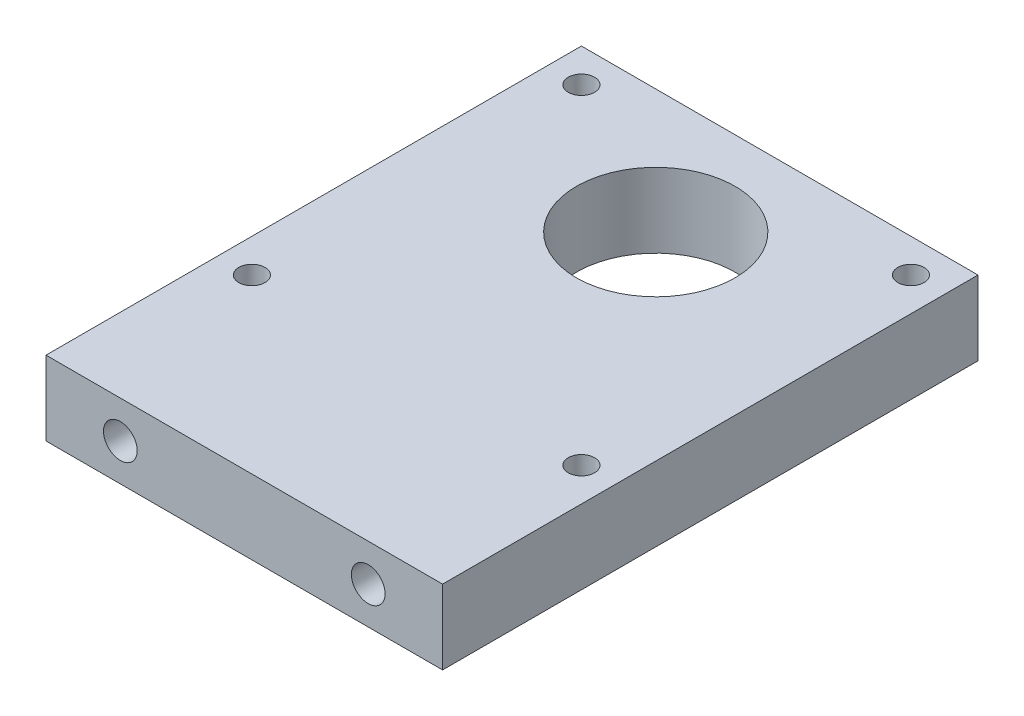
ISO-10303-21;
HEADER;
FILE_DESCRIPTION(('STEP AP214'),'2;1');
FILE_NAME('part.step','',(''),(''),'','','');
FILE_SCHEMA(('AUTOMOTIVE_DESIGN { 1 0 10303 214 1 1 1 1 }'));
ENDSEC;
DATA;
#1=APPLICATION_CONTEXT('core data for automotive mechanical design processes');
#2=APPLICATION_PROTOCOL_DEFINITION('international standard','automotive_design',2000,#1);
#3=PRODUCT_CONTEXT('',#1,'mechanical');
#4=PRODUCT('Part','Part','',(#3));
#5=PRODUCT_RELATED_PRODUCT_CATEGORY('part','',(#4));
#6=PRODUCT_DEFINITION_FORMATION('','',#4);
#7=PRODUCT_DEFINITION_CONTEXT('part definition',#1,'design');
#8=PRODUCT_DEFINITION('design','',#6,#7);
#9=PRODUCT_DEFINITION_SHAPE('','',#8);
#10=(LENGTH_UNIT() NAMED_UNIT(*) SI_UNIT(.MILLI.,.METRE.));
#11=(NAMED_UNIT(*) PLANE_ANGLE_UNIT() SI_UNIT($,.RADIAN.));
#12=(NAMED_UNIT(*) SI_UNIT($,.STERADIAN.) SOLID_ANGLE_UNIT());
#13=UNCERTAINTY_MEASURE_WITH_UNIT(LENGTH_MEASURE(1.E-05),#10,'distance_accuracy_value','');
#14=(GEOMETRIC_REPRESENTATION_CONTEXT(3) GLOBAL_UNCERTAINTY_ASSIGNED_CONTEXT((#13)) GLOBAL_UNIT_ASSIGNED_CONTEXT((#10,
#11,#12)) REPRESENTATION_CONTEXT('',''));
#15=CARTESIAN_POINT('',(0.,0.,0.));
#16=DIRECTION('',(0.,0.,1.));
#17=DIRECTION('',(1.,0.,0.));
#18=AXIS2_PLACEMENT_3D('',#15,#16,#17);
#19=CARTESIAN_POINT('',(25.,7.5,34.2499999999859));
#20=DIRECTION('',(0.,0.,1.));
#21=DIRECTION('',(1.,0.,0.));
#22=AXIS2_PLACEMENT_3D('',#19,#20,#21);
#23=CONICAL_SURFACE('',#22,3.40000000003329,1.02974425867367);
#24=CARTESIAN_POINT('',(25.0000000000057,7.5,32.2070738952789));
#25=VERTEX_POINT('',#24);
#26=VERTEX_LOOP('',#25);
#27=FACE_BOUND('',#26,.T.);
#28=CARTESIAN_POINT('',(25.,7.5,34.25));
#29=DIRECTION('',(0.,0.,1.));
#30=DIRECTION('',(1.,0.,0.));
#31=AXIS2_PLACEMENT_3D('',#28,#29,#30);
#32=CIRCLE('',#31,3.4);
#33=CARTESIAN_POINT('',(28.4,7.5,34.25));
#34=VERTEX_POINT('',#33);
#35=EDGE_CURVE('E66',#34,#34,#32,.T.);
#36=ORIENTED_EDGE('',*,*,#35,.T.);
#37=EDGE_LOOP('',(#36));
#38=FACE_BOUND('',#37,.T.);
#39=ADVANCED_FACE('F17',(#27,#38),#23,.F.);
#40=CARTESIAN_POINT('',(-25.,7.49999999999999,34.2499999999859));
#41=DIRECTION('',(0.,0.,1.));
#42=DIRECTION('',(1.,0.,0.));
#43=AXIS2_PLACEMENT_3D('',#40,#41,#42);
#44=CONICAL_SURFACE('',#43,3.40000000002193,1.02974425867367);
#45=CARTESIAN_POINT('',(-25.0000000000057,7.49999999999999,32.2070738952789));
#46=VERTEX_POINT('',#45);
#47=VERTEX_LOOP('',#46);
#48=FACE_BOUND('',#47,.T.);
#49=CARTESIAN_POINT('',(-25.,7.49999999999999,34.25));
#50=DIRECTION('',(0.,0.,1.));
#51=DIRECTION('',(1.,0.,0.));
#52=AXIS2_PLACEMENT_3D('',#49,#50,#51);
#53=CIRCLE('',#52,3.4);
#54=CARTESIAN_POINT('',(-21.6,7.49999999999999,34.25));
#55=VERTEX_POINT('',#54);
#56=EDGE_CURVE('E68',#55,#55,#53,.T.);
#57=ORIENTED_EDGE('',*,*,#56,.T.);
#58=EDGE_LOOP('',(#57));
#59=FACE_BOUND('',#58,.T.);
#60=ADVANCED_FACE('F63',(#48,#59),#44,.F.);
#61=CARTESIAN_POINT('',(-33.2340187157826,0.,-47.2340187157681));
#62=DIRECTION('',(0.,-1.,0.));
#63=DIRECTION('',(0.,0.,-1.));
#64=AXIS2_PLACEMENT_3D('',#61,#62,#63);
#65=CYLINDRICAL_SURFACE('',#64,5.);
#66=CARTESIAN_POINT('',(-33.2340187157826,5.7,-47.2340187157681));
#67=DIRECTION('',(0.,-1.,0.));
#68=DIRECTION('',(0.,0.,-1.));
#69=AXIS2_PLACEMENT_3D('',#66,#67,#68);
#70=CIRCLE('',#69,5.);
#71=CARTESIAN_POINT('',(-33.2340187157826,5.7,-52.2340187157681));
#72=VERTEX_POINT('',#71);
#73=EDGE_CURVE('E20',#72,#72,#70,.F.);
#74=ORIENTED_EDGE('',*,*,#73,.T.);
#75=EDGE_LOOP('',(#74));
#76=FACE_BOUND('',#75,.T.);
#77=CARTESIAN_POINT('',(-33.2340187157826,0.,-47.2340187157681));
#78=DIRECTION('',(0.,-1.,0.));
#79=DIRECTION('',(0.,0.,-1.));
#80=AXIS2_PLACEMENT_3D('',#77,#78,#79);
#81=CIRCLE('',#80,5.);
#82=CARTESIAN_POINT('',(-33.2340187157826,0.,-52.2340187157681));
#83=VERTEX_POINT('',#82);
#84=EDGE_CURVE('E72',#83,#83,#81,.T.);
#85=ORIENTED_EDGE('',*,*,#84,.T.);
#86=EDGE_LOOP('',(#85));
#87=FACE_BOUND('',#86,.T.);
#88=ADVANCED_FACE('F138',(#76,#87),#65,.F.);
#89=CARTESIAN_POINT('',(-33.2340187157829,0.,19.2340187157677));
#90=DIRECTION('',(0.,-1.,0.));
#91=DIRECTION('',(0.,0.,-1.));
#92=AXIS2_PLACEMENT_3D('',#89,#90,#91);
#93=CYLINDRICAL_SURFACE('',#92,5.);
#94=CARTESIAN_POINT('',(-33.2340187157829,5.7,19.2340187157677));
#95=DIRECTION('',(0.,-1.,0.));
#96=DIRECTION('',(0.,0.,-1.));
#97=AXIS2_PLACEMENT_3D('',#94,#95,#96);
#98=CIRCLE('',#97,5.);
#99=CARTESIAN_POINT('',(-33.2340187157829,5.7,14.2340187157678));
#100=VERTEX_POINT('',#99);
#101=EDGE_CURVE('E131',#100,#100,#98,.F.);
#102=ORIENTED_EDGE('',*,*,#101,.T.);
#103=EDGE_LOOP('',(#102));
#104=FACE_BOUND('',#103,.T.);
#105=CARTESIAN_POINT('',(-33.2340187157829,0.,19.2340187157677));
#106=DIRECTION('',(0.,-1.,0.));
#107=DIRECTION('',(0.,0.,-1.));
#108=AXIS2_PLACEMENT_3D('',#105,#106,#107);
#109=CIRCLE('',#108,5.);
#110=CARTESIAN_POINT('',(-33.2340187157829,0.,14.2340187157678));
#111=VERTEX_POINT('',#110);
#112=EDGE_CURVE('E125',#111,#111,#109,.T.);
#113=ORIENTED_EDGE('',*,*,#112,.T.);
#114=EDGE_LOOP('',(#113));
#115=FACE_BOUND('',#114,.T.);
#116=ADVANCED_FACE('F224',(#104,#115),#93,.F.);
#117=CARTESIAN_POINT('',(33.2340187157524,0.,19.2340187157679));
#118=DIRECTION('',(0.,-1.,0.));
#119=DIRECTION('',(0.,0.,-1.));
#120=AXIS2_PLACEMENT_3D('',#117,#118,#119);
#121=CYLINDRICAL_SURFACE('',#120,4.99999999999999);
#122=CARTESIAN_POINT('',(33.2340187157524,5.7,19.2340187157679));
#123=DIRECTION('',(0.,-1.,0.));
#124=DIRECTION('',(0.,0.,-1.));
#125=AXIS2_PLACEMENT_3D('',#122,#123,#124);
#126=CIRCLE('',#125,4.99999999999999);
#127=CARTESIAN_POINT('',(33.2340187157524,5.7,14.2340187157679));
#128=VERTEX_POINT('',#127);
#129=EDGE_CURVE('E75',#128,#128,#126,.F.);
#130=ORIENTED_EDGE('',*,*,#129,.T.);
#131=EDGE_LOOP('',(#130));
#132=FACE_BOUND('',#131,.T.);
#133=CARTESIAN_POINT('',(33.2340187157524,0.,19.2340187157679));
#134=DIRECTION('',(0.,-1.,0.));
#135=DIRECTION('',(0.,0.,-1.));
#136=AXIS2_PLACEMENT_3D('',#133,#134,#135);
#137=CIRCLE('',#136,4.99999999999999);
#138=CARTESIAN_POINT('',(33.2340187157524,0.,14.2340187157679));
#139=VERTEX_POINT('',#138);
#140=EDGE_CURVE('E122',#139,#139,#137,.T.);
#141=ORIENTED_EDGE('',*,*,#140,.T.);
#142=EDGE_LOOP('',(#141));
#143=FACE_BOUND('',#142,.T.);
#144=ADVANCED_FACE('F220',(#132,#143),#121,.F.);
#145=CARTESIAN_POINT('',(33.2340187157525,0.,-47.2340187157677));
#146=DIRECTION('',(0.,-1.,0.));
#147=DIRECTION('',(0.,0.,-1.));
#148=AXIS2_PLACEMENT_3D('',#145,#146,#147);
#149=CYLINDRICAL_SURFACE('',#148,5.);
#150=CARTESIAN_POINT('',(33.2340187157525,5.7,-47.2340187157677));
#151=DIRECTION('',(0.,-1.,0.));
#152=DIRECTION('',(0.,0.,-1.));
#153=AXIS2_PLACEMENT_3D('',#150,#151,#152);
#154=CIRCLE('',#153,5.);
#155=CARTESIAN_POINT('',(33.2340187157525,5.7,-52.2340187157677));
#156=VERTEX_POINT('',#155);
#157=EDGE_CURVE('E69',#156,#156,#154,.F.);
#158=ORIENTED_EDGE('',*,*,#157,.T.);
#159=EDGE_LOOP('',(#158));
#160=FACE_BOUND('',#159,.T.);
#161=CARTESIAN_POINT('',(33.2340187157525,0.,-47.2340187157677));
#162=DIRECTION('',(0.,-1.,0.));
#163=DIRECTION('',(0.,0.,-1.));
#164=AXIS2_PLACEMENT_3D('',#161,#162,#163);
#165=CIRCLE('',#164,5.);
#166=CARTESIAN_POINT('',(33.2340187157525,0.,-52.2340187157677));
#167=VERTEX_POINT('',#166);
#168=EDGE_CURVE('E119',#167,#167,#165,.T.);
#169=ORIENTED_EDGE('',*,*,#168,.T.);
#170=EDGE_LOOP('',(#169));
#171=FACE_BOUND('',#170,.T.);
#172=ADVANCED_FACE('F145',(#160,#171),#149,.F.);
#173=CARTESIAN_POINT('',(-30.5840187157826,5.7,-47.2340187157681));
#174=DIRECTION('',(0.,1.,0.));
#175=DIRECTION('',(0.,0.,1.));
#176=AXIS2_PLACEMENT_3D('',#173,#174,#175);
#177=PLANE('',#176);
#178=ORIENTED_EDGE('',*,*,#73,.F.);
#179=EDGE_LOOP('',(#178));
#180=FACE_BOUND('',#179,.T.);
#181=CARTESIAN_POINT('',(-33.2340187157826,5.7,-47.2340187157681));
#182=DIRECTION('',(0.,-1.,0.));
#183=DIRECTION('',(0.,0.,-1.));
#184=AXIS2_PLACEMENT_3D('',#181,#182,#183);
#185=CIRCLE('',#184,2.65);
#186=CARTESIAN_POINT('',(-33.2340187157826,5.7,-49.8840187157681));
#187=VERTEX_POINT('',#186);
#188=EDGE_CURVE('E116',#187,#187,#185,.F.);
#189=ORIENTED_EDGE('',*,*,#188,.T.);
#190=EDGE_LOOP('',(#189));
#191=FACE_BOUND('',#190,.T.);
#192=ADVANCED_FACE('F141',(#180,#191),#177,.F.);
#193=CARTESIAN_POINT('',(-30.5840187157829,5.7,19.2340187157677));
#194=DIRECTION('',(0.,1.,0.));
#195=DIRECTION('',(0.,0.,1.));
#196=AXIS2_PLACEMENT_3D('',#193,#194,#195);
#197=PLANE('',#196);
#198=ORIENTED_EDGE('',*,*,#101,.F.);
#199=EDGE_LOOP('',(#198));
#200=FACE_BOUND('',#199,.T.);
#201=CARTESIAN_POINT('',(-33.2340187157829,5.7,19.2340187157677));
#202=DIRECTION('',(0.,-1.,0.));
#203=DIRECTION('',(0.,0.,-1.));
#204=AXIS2_PLACEMENT_3D('',#201,#202,#203);
#205=CIRCLE('',#204,2.65);
#206=CARTESIAN_POINT('',(-33.2340187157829,5.7,16.5840187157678));
#207=VERTEX_POINT('',#206);
#208=EDGE_CURVE('E113',#207,#207,#205,.F.);
#209=ORIENTED_EDGE('',*,*,#208,.T.);
#210=EDGE_LOOP('',(#209));
#211=FACE_BOUND('',#210,.T.);
#212=ADVANCED_FACE('F144',(#200,#211),#197,.F.);
#213=CARTESIAN_POINT('',(35.8840187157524,5.7,19.2340187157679));
#214=DIRECTION('',(0.,1.,0.));
#215=DIRECTION('',(0.,0.,1.));
#216=AXIS2_PLACEMENT_3D('',#213,#214,#215);
#217=PLANE('',#216);
#218=ORIENTED_EDGE('',*,*,#129,.F.);
#219=EDGE_LOOP('',(#218));
#220=FACE_BOUND('',#219,.T.);
#221=CARTESIAN_POINT('',(33.2340187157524,5.7,19.2340187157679));
#222=DIRECTION('',(0.,-1.,0.));
#223=DIRECTION('',(0.,0.,-1.));
#224=AXIS2_PLACEMENT_3D('',#221,#222,#223);
#225=CIRCLE('',#224,2.65);
#226=CARTESIAN_POINT('',(33.2340187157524,5.7,16.5840187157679));
#227=VERTEX_POINT('',#226);
#228=EDGE_CURVE('E110',#227,#227,#225,.F.);
#229=ORIENTED_EDGE('',*,*,#228,.T.);
#230=EDGE_LOOP('',(#229));
#231=FACE_BOUND('',#230,.T.);
#232=ADVANCED_FACE('F210',(#220,#231),#217,.F.);
#233=CARTESIAN_POINT('',(35.8840187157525,5.7,-47.2340187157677));
#234=DIRECTION('',(0.,1.,0.));
#235=DIRECTION('',(0.,0.,1.));
#236=AXIS2_PLACEMENT_3D('',#233,#234,#235);
#237=PLANE('',#236);
#238=ORIENTED_EDGE('',*,*,#157,.F.);
#239=EDGE_LOOP('',(#238));
#240=FACE_BOUND('',#239,.T.);
#241=CARTESIAN_POINT('',(33.2340187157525,5.7,-47.2340187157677));
#242=DIRECTION('',(0.,-1.,0.));
#243=DIRECTION('',(0.,0.,-1.));
#244=AXIS2_PLACEMENT_3D('',#241,#242,#243);
#245=CIRCLE('',#244,2.65);
#246=CARTESIAN_POINT('',(33.2340187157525,5.7,-49.8840187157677));
#247=VERTEX_POINT('',#246);
#248=EDGE_CURVE('E107',#247,#247,#245,.F.);
#249=ORIENTED_EDGE('',*,*,#248,.T.);
#250=EDGE_LOOP('',(#249));
#251=FACE_BOUND('',#250,.T.);
#252=ADVANCED_FACE('F207',(#240,#251),#237,.F.);
#253=CARTESIAN_POINT('',(25.,7.5,54.));
#254=DIRECTION('',(0.,0.,1.));
#255=DIRECTION('',(1.,0.,0.));
#256=AXIS2_PLACEMENT_3D('',#253,#254,#255);
#257=CYLINDRICAL_SURFACE('',#256,3.4);
#258=ORIENTED_EDGE('',*,*,#35,.F.);
#259=EDGE_LOOP('',(#258));
#260=FACE_BOUND('',#259,.T.);
#261=CARTESIAN_POINT('',(25.,7.5,54.));
#262=DIRECTION('',(0.,0.,1.));
#263=DIRECTION('',(1.,0.,0.));
#264=AXIS2_PLACEMENT_3D('',#261,#262,#263);
#265=CIRCLE('',#264,3.4);
#266=CARTESIAN_POINT('',(28.4,7.5,54.));
#267=VERTEX_POINT('',#266);
#268=EDGE_CURVE('E99',#267,#267,#265,.T.);
#269=ORIENTED_EDGE('',*,*,#268,.T.);
#270=EDGE_LOOP('',(#269));
#271=FACE_BOUND('',#270,.T.);
#272=ADVANCED_FACE('F203',(#260,#271),#257,.F.);
#273=CARTESIAN_POINT('',(-25.,7.49999999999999,54.));
#274=DIRECTION('',(0.,0.,1.));
#275=DIRECTION('',(1.,0.,0.));
#276=AXIS2_PLACEMENT_3D('',#273,#274,#275);
#277=CYLINDRICAL_SURFACE('',#276,3.4);
#278=ORIENTED_EDGE('',*,*,#56,.F.);
#279=EDGE_LOOP('',(#278));
#280=FACE_BOUND('',#279,.T.);
#281=CARTESIAN_POINT('',(-25.,7.49999999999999,54.));
#282=DIRECTION('',(0.,0.,1.));
#283=DIRECTION('',(1.,0.,0.));
#284=AXIS2_PLACEMENT_3D('',#281,#282,#283);
#285=CIRCLE('',#284,3.4);
#286=CARTESIAN_POINT('',(-21.6,7.49999999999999,54.));
#287=VERTEX_POINT('',#286);
#288=EDGE_CURVE('E96',#287,#287,#285,.T.);
#289=ORIENTED_EDGE('',*,*,#288,.T.);
#290=EDGE_LOOP('',(#289));
#291=FACE_BOUND('',#290,.T.);
#292=ADVANCED_FACE('F199',(#280,#291),#277,.F.);
#293=CARTESIAN_POINT('',(0.,0.,0.));
#294=DIRECTION('',(0.,1.,0.));
#295=DIRECTION('',(0.,0.,1.));
#296=AXIS2_PLACEMENT_3D('',#293,#294,#295);
#297=PLANE('',#296);
#298=DIRECTION('',(-1.,0.,0.));
#299=VECTOR('',#298,1.);
#300=CARTESIAN_POINT('',(-40.,0.,54.));
#301=LINE('',#300,#299);
#302=CARTESIAN_POINT('',(40.,0.,54.));
#303=VERTEX_POINT('',#302);
#304=CARTESIAN_POINT('',(-40.,0.,54.));
#305=VERTEX_POINT('',#304);
#306=EDGE_CURVE('E95',#303,#305,#301,.T.);
#307=ORIENTED_EDGE('',*,*,#306,.T.);
#308=DIRECTION('',(0.,0.,-1.));
#309=VECTOR('',#308,1.);
#310=CARTESIAN_POINT('',(-40.,0.,-54.));
#311=LINE('',#310,#309);
#312=CARTESIAN_POINT('',(-40.,0.,-54.));
#313=VERTEX_POINT('',#312);
#314=EDGE_CURVE('E102',#305,#313,#311,.T.);
#315=ORIENTED_EDGE('',*,*,#314,.T.);
#316=DIRECTION('',(1.,0.,0.));
#317=VECTOR('',#316,1.);
#318=CARTESIAN_POINT('',(-40.,0.,-54.));
#319=LINE('',#318,#317);
#320=CARTESIAN_POINT('',(40.,0.,-54.));
#321=VERTEX_POINT('',#320);
#322=EDGE_CURVE('E427',#313,#321,#319,.T.);
#323=ORIENTED_EDGE('',*,*,#322,.T.);
#324=DIRECTION('',(0.,0.,1.));
#325=VECTOR('',#324,1.);
#326=CARTESIAN_POINT('',(40.,0.,-54.));
#327=LINE('',#326,#325);
#328=EDGE_CURVE('E106',#321,#303,#327,.T.);
#329=ORIENTED_EDGE('',*,*,#328,.T.);
#330=EDGE_LOOP('',(#307,#315,#323,#329));
#331=FACE_BOUND('',#330,.T.);
#332=CARTESIAN_POINT('',(0.,0.,-29.));
#333=DIRECTION('',(0.,1.,0.));
#334=DIRECTION('',(0.,0.,1.));
#335=AXIS2_PLACEMENT_3D('',#332,#333,#334);
#336=CIRCLE('',#335,16.);
#337=CARTESIAN_POINT('',(0.,0.,-13.));
#338=VERTEX_POINT('',#337);
#339=EDGE_CURVE('E103',#338,#338,#336,.T.);
#340=ORIENTED_EDGE('',*,*,#339,.T.);
#341=EDGE_LOOP('',(#340));
#342=FACE_BOUND('',#341,.T.);
#343=ORIENTED_EDGE('',*,*,#168,.F.);
#344=EDGE_LOOP('',(#343));
#345=FACE_BOUND('',#344,.T.);
#346=ORIENTED_EDGE('',*,*,#140,.F.);
#347=EDGE_LOOP('',(#346));
#348=FACE_BOUND('',#347,.T.);
#349=ORIENTED_EDGE('',*,*,#112,.F.);
#350=EDGE_LOOP('',(#349));
#351=FACE_BOUND('',#350,.T.);
#352=ORIENTED_EDGE('',*,*,#84,.F.);
#353=EDGE_LOOP('',(#352));
#354=FACE_BOUND('',#353,.T.);
#355=ADVANCED_FACE('F153',(#331,#342,#345,#348,#351,#354),#297,.F.);
#356=CARTESIAN_POINT('',(-33.2340187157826,0.,-47.2340187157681));
#357=DIRECTION('',(0.,-1.,0.));
#358=DIRECTION('',(0.,0.,-1.));
#359=AXIS2_PLACEMENT_3D('',#356,#357,#358);
#360=CYLINDRICAL_SURFACE('',#359,2.65);
#361=ORIENTED_EDGE('',*,*,#188,.F.);
#362=EDGE_LOOP('',(#361));
#363=FACE_BOUND('',#362,.T.);
#364=CARTESIAN_POINT('',(-33.2340187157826,15.,-47.2340187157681));
#365=DIRECTION('',(0.,-1.,0.));
#366=DIRECTION('',(0.,0.,-1.));
#367=AXIS2_PLACEMENT_3D('',#364,#365,#366);
#368=CIRCLE('',#367,2.65);
#369=CARTESIAN_POINT('',(-33.2340187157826,15.,-49.8840187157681));
#370=VERTEX_POINT('',#369);
#371=EDGE_CURVE('E92',#370,#370,#368,.T.);
#372=ORIENTED_EDGE('',*,*,#371,.F.);
#373=EDGE_LOOP('',(#372));
#374=FACE_BOUND('',#373,.T.);
#375=ADVANCED_FACE('F149',(#363,#374),#360,.F.);
#376=CARTESIAN_POINT('',(-33.2340187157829,0.,19.2340187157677));
#377=DIRECTION('',(0.,-1.,0.));
#378=DIRECTION('',(0.,0.,-1.));
#379=AXIS2_PLACEMENT_3D('',#376,#377,#378);
#380=CYLINDRICAL_SURFACE('',#379,2.65);
#381=ORIENTED_EDGE('',*,*,#208,.F.);
#382=EDGE_LOOP('',(#381));
#383=FACE_BOUND('',#382,.T.);
#384=CARTESIAN_POINT('',(-33.2340187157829,15.,19.2340187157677));
#385=DIRECTION('',(0.,-1.,0.));
#386=DIRECTION('',(0.,0.,-1.));
#387=AXIS2_PLACEMENT_3D('',#384,#385,#386);
#388=CIRCLE('',#387,2.65);
#389=CARTESIAN_POINT('',(-33.2340187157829,15.,16.5840187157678));
#390=VERTEX_POINT('',#389);
#391=EDGE_CURVE('E89',#390,#390,#388,.T.);
#392=ORIENTED_EDGE('',*,*,#391,.F.);
#393=EDGE_LOOP('',(#392));
#394=FACE_BOUND('',#393,.T.);
#395=ADVANCED_FACE('F152',(#383,#394),#380,.F.);
#396=CARTESIAN_POINT('',(33.2340187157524,0.,19.2340187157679));
#397=DIRECTION('',(0.,-1.,0.));
#398=DIRECTION('',(0.,0.,-1.));
#399=AXIS2_PLACEMENT_3D('',#396,#397,#398);
#400=CYLINDRICAL_SURFACE('',#399,2.65);
#401=ORIENTED_EDGE('',*,*,#228,.F.);
#402=EDGE_LOOP('',(#401));
#403=FACE_BOUND('',#402,.T.);
#404=CARTESIAN_POINT('',(33.2340187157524,15.,19.2340187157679));
#405=DIRECTION('',(0.,-1.,0.));
#406=DIRECTION('',(0.,0.,-1.));
#407=AXIS2_PLACEMENT_3D('',#404,#405,#406);
#408=CIRCLE('',#407,2.65);
#409=CARTESIAN_POINT('',(33.2340187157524,15.,16.5840187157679));
#410=VERTEX_POINT('',#409);
#411=EDGE_CURVE('E86',#410,#410,#408,.T.);
#412=ORIENTED_EDGE('',*,*,#411,.F.);
#413=EDGE_LOOP('',(#412));
#414=FACE_BOUND('',#413,.T.);
#415=ADVANCED_FACE('F189',(#403,#414),#400,.F.);
#416=CARTESIAN_POINT('',(33.2340187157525,0.,-47.2340187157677));
#417=DIRECTION('',(0.,-1.,0.));
#418=DIRECTION('',(0.,0.,-1.));
#419=AXIS2_PLACEMENT_3D('',#416,#417,#418);
#420=CYLINDRICAL_SURFACE('',#419,2.65);
#421=ORIENTED_EDGE('',*,*,#248,.F.);
#422=EDGE_LOOP('',(#421));
#423=FACE_BOUND('',#422,.T.);
#424=CARTESIAN_POINT('',(33.2340187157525,15.,-47.2340187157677));
#425=DIRECTION('',(0.,-1.,0.));
#426=DIRECTION('',(0.,0.,-1.));
#427=AXIS2_PLACEMENT_3D('',#424,#425,#426);
#428=CIRCLE('',#427,2.65);
#429=CARTESIAN_POINT('',(33.2340187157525,15.,-49.8840187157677));
#430=VERTEX_POINT('',#429);
#431=EDGE_CURVE('E83',#430,#430,#428,.T.);
#432=ORIENTED_EDGE('',*,*,#431,.F.);
#433=EDGE_LOOP('',(#432));
#434=FACE_BOUND('',#433,.T.);
#435=ADVANCED_FACE('F185',(#423,#434),#420,.F.);
#436=CARTESIAN_POINT('',(0.,0.,-29.));
#437=DIRECTION('',(0.,1.,0.));
#438=DIRECTION('',(0.,0.,1.));
#439=AXIS2_PLACEMENT_3D('',#436,#437,#438);
#440=CYLINDRICAL_SURFACE('',#439,16.);
#441=CARTESIAN_POINT('',(0.,15.,-29.));
#442=DIRECTION('',(0.,1.,0.));
#443=DIRECTION('',(0.,0.,1.));
#444=AXIS2_PLACEMENT_3D('',#441,#442,#443);
#445=CIRCLE('',#444,16.);
#446=CARTESIAN_POINT('',(0.,15.,-13.));
#447=VERTEX_POINT('',#446);
#448=EDGE_CURVE('E79',#447,#447,#445,.F.);
#449=ORIENTED_EDGE('',*,*,#448,.F.);
#450=EDGE_LOOP('',(#449));
#451=FACE_BOUND('',#450,.T.);
#452=ORIENTED_EDGE('',*,*,#339,.F.);
#453=EDGE_LOOP('',(#452));
#454=FACE_BOUND('',#453,.T.);
#455=ADVANCED_FACE('F181',(#451,#454),#440,.F.);
#456=CARTESIAN_POINT('',(40.,15.,-54.));
#457=DIRECTION('',(-1.,0.,0.));
#458=DIRECTION('',(0.,0.,1.));
#459=AXIS2_PLACEMENT_3D('',#456,#457,#458);
#460=PLANE('',#459);
#461=DIRECTION('',(0.,1.,0.));
#462=VECTOR('',#461,1.);
#463=CARTESIAN_POINT('',(40.,15.,-54.));
#464=LINE('',#463,#462);
#465=CARTESIAN_POINT('',(40.,15.,-54.));
#466=VERTEX_POINT('',#465);
#467=EDGE_CURVE('E429',#321,#466,#464,.T.);
#468=ORIENTED_EDGE('',*,*,#467,.T.);
#469=DIRECTION('',(0.,0.,1.));
#470=VECTOR('',#469,1.);
#471=CARTESIAN_POINT('',(40.,15.,0.));
#472=LINE('',#471,#470);
#473=CARTESIAN_POINT('',(40.,15.,54.));
#474=VERTEX_POINT('',#473);
#475=EDGE_CURVE('E82',#474,#466,#472,.F.);
#476=ORIENTED_EDGE('',*,*,#475,.F.);
#477=DIRECTION('',(0.,1.,0.));
#478=VECTOR('',#477,1.);
#479=CARTESIAN_POINT('',(40.,15.,54.));
#480=LINE('',#479,#478);
#481=EDGE_CURVE('E419',#474,#303,#480,.F.);
#482=ORIENTED_EDGE('',*,*,#481,.T.);
#483=ORIENTED_EDGE('',*,*,#328,.F.);
#484=EDGE_LOOP('',(#468,#476,#482,#483));
#485=FACE_BOUND('',#484,.T.);
#486=ADVANCED_FACE('F177',(#485),#460,.F.);
#487=CARTESIAN_POINT('',(-40.,15.,-54.));
#488=DIRECTION('',(0.,0.,1.));
#489=DIRECTION('',(1.,0.,0.));
#490=AXIS2_PLACEMENT_3D('',#487,#488,#489);
#491=PLANE('',#490);
#492=DIRECTION('',(0.,1.,0.));
#493=VECTOR('',#492,1.);
#494=CARTESIAN_POINT('',(-40.,15.,-54.));
#495=LINE('',#494,#493);
#496=CARTESIAN_POINT('',(-40.,15.,-54.));
#497=VERTEX_POINT('',#496);
#498=EDGE_CURVE('E425',#313,#497,#495,.T.);
#499=ORIENTED_EDGE('',*,*,#498,.T.);
#500=DIRECTION('',(1.,0.,0.));
#501=VECTOR('',#500,1.);
#502=CARTESIAN_POINT('',(0.,15.,-54.));
#503=LINE('',#502,#501);
#504=EDGE_CURVE('E434',#466,#497,#503,.F.);
#505=ORIENTED_EDGE('',*,*,#504,.F.);
#506=ORIENTED_EDGE('',*,*,#467,.F.);
#507=ORIENTED_EDGE('',*,*,#322,.F.);
#508=EDGE_LOOP('',(#499,#505,#506,#507));
#509=FACE_BOUND('',#508,.T.);
#510=ADVANCED_FACE('F174',(#509),#491,.F.);
#511=CARTESIAN_POINT('',(-40.,15.,-54.));
#512=DIRECTION('',(1.,0.,0.));
#513=DIRECTION('',(0.,0.,-1.));
#514=AXIS2_PLACEMENT_3D('',#511,#512,#513);
#515=PLANE('',#514);
#516=DIRECTION('',(0.,1.,0.));
#517=VECTOR('',#516,1.);
#518=CARTESIAN_POINT('',(-40.,15.,54.));
#519=LINE('',#518,#517);
#520=CARTESIAN_POINT('',(-40.,15.,54.));
#521=VERTEX_POINT('',#520);
#522=EDGE_CURVE('E35',#305,#521,#519,.T.);
#523=ORIENTED_EDGE('',*,*,#522,.T.);
#524=DIRECTION('',(0.,0.,1.));
#525=VECTOR('',#524,1.);
#526=CARTESIAN_POINT('',(-40.,15.,0.));
#527=LINE('',#526,#525);
#528=EDGE_CURVE('E26',#497,#521,#527,.T.);
#529=ORIENTED_EDGE('',*,*,#528,.F.);
#530=ORIENTED_EDGE('',*,*,#498,.F.);
#531=ORIENTED_EDGE('',*,*,#314,.F.);
#532=EDGE_LOOP('',(#523,#529,#530,#531));
#533=FACE_BOUND('',#532,.T.);
#534=ADVANCED_FACE('F166',(#533),#515,.F.);
#535=CARTESIAN_POINT('',(-40.,15.,54.));
#536=DIRECTION('',(0.,0.,-1.));
#537=DIRECTION('',(-1.,0.,0.));
#538=AXIS2_PLACEMENT_3D('',#535,#536,#537);
#539=PLANE('',#538);
#540=ORIENTED_EDGE('',*,*,#481,.F.);
#541=DIRECTION('',(1.,0.,0.));
#542=VECTOR('',#541,1.);
#543=CARTESIAN_POINT('',(0.,15.,54.));
#544=LINE('',#543,#542);
#545=EDGE_CURVE('E11',#521,#474,#544,.T.);
#546=ORIENTED_EDGE('',*,*,#545,.F.);
#547=ORIENTED_EDGE('',*,*,#522,.F.);
#548=ORIENTED_EDGE('',*,*,#306,.F.);
#549=EDGE_LOOP('',(#540,#546,#547,#548));
#550=FACE_BOUND('',#549,.T.);
#551=ORIENTED_EDGE('',*,*,#288,.F.);
#552=EDGE_LOOP('',(#551));
#553=FACE_BOUND('',#552,.T.);
#554=ORIENTED_EDGE('',*,*,#268,.F.);
#555=EDGE_LOOP('',(#554));
#556=FACE_BOUND('',#555,.T.);
#557=ADVANCED_FACE('F159',(#550,#553,#556),#539,.F.);
#558=CARTESIAN_POINT('',(0.,15.,0.));
#559=DIRECTION('',(0.,1.,0.));
#560=DIRECTION('',(0.,0.,1.));
#561=AXIS2_PLACEMENT_3D('',#558,#559,#560);
#562=PLANE('',#561);
#563=ORIENTED_EDGE('',*,*,#528,.T.);
#564=ORIENTED_EDGE('',*,*,#545,.T.);
#565=ORIENTED_EDGE('',*,*,#475,.T.);
#566=ORIENTED_EDGE('',*,*,#504,.T.);
#567=EDGE_LOOP('',(#563,#564,#565,#566));
#568=FACE_BOUND('',#567,.T.);
#569=ORIENTED_EDGE('',*,*,#448,.T.);
#570=EDGE_LOOP('',(#569));
#571=FACE_BOUND('',#570,.T.);
#572=ORIENTED_EDGE('',*,*,#431,.T.);
#573=EDGE_LOOP('',(#572));
#574=FACE_BOUND('',#573,.T.);
#575=ORIENTED_EDGE('',*,*,#411,.T.);
#576=EDGE_LOOP('',(#575));
#577=FACE_BOUND('',#576,.T.);
#578=ORIENTED_EDGE('',*,*,#391,.T.);
#579=EDGE_LOOP('',(#578));
#580=FACE_BOUND('',#579,.T.);
#581=ORIENTED_EDGE('',*,*,#371,.T.);
#582=EDGE_LOOP('',(#581));
#583=FACE_BOUND('',#582,.T.);
#584=ADVANCED_FACE('F157',(#568,#571,#574,#577,#580,#583),#562,.T.);
#585=CLOSED_SHELL('',(#39,#60,#88,#116,#144,#172,#192,#212,#232,#252,#272,#292,#355,#375,#395,
#415,#435,#455,#486,#510,#534,#557,#584));
#586=MANIFOLD_SOLID_BREP('B1',#585);
#587=ADVANCED_BREP_SHAPE_REPRESENTATION('',(#18,#586),#14);
#588=SHAPE_DEFINITION_REPRESENTATION(#9,#587);
ENDSEC;
END-ISO-10303-21;
